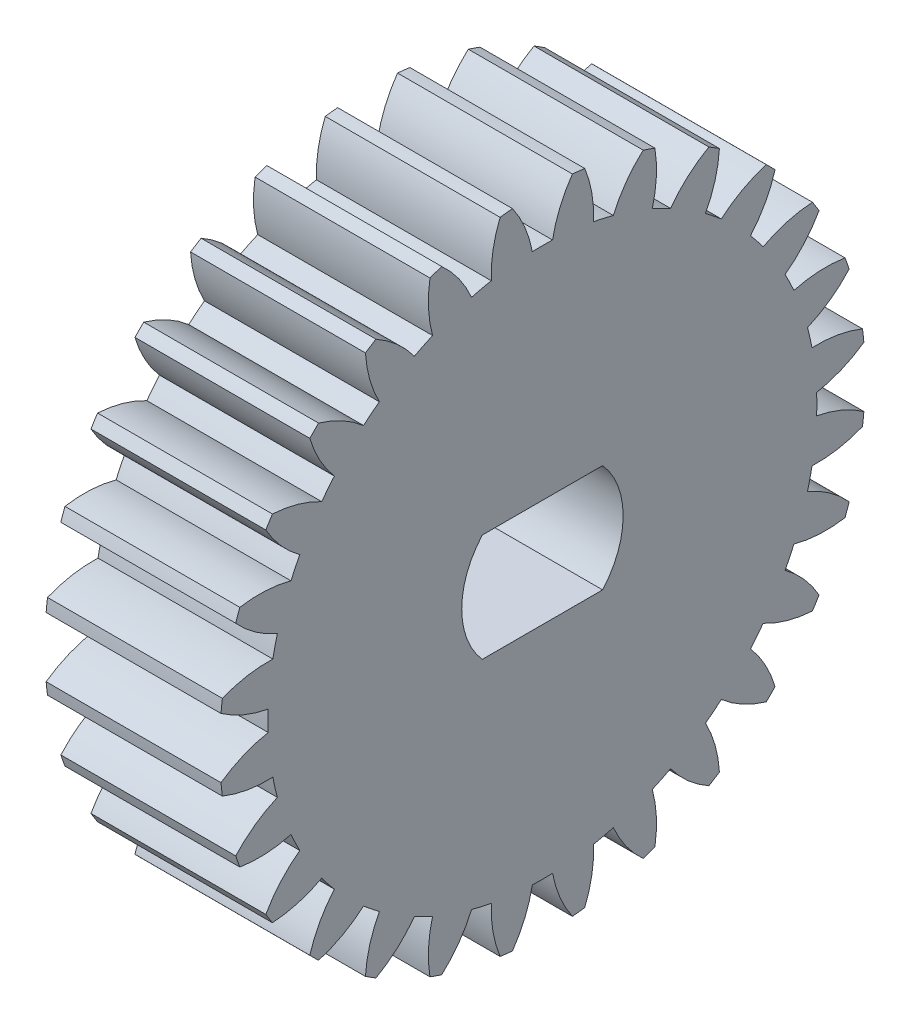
from build123d import *

# Parameters (mm, degrees)
BASPROSKE_W     = 6.5
BASPROSKE_H     = 12
TOOTHCUT_DEPTH  = 19.172781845
TEETHCUTS_COUNT = 28
BORE_DEPTH      = 50.0000508


with BuildPart() as part:
    # BasProSke → Base-Revolve (revolve)
    with BuildSketch(Plane(origin=(0, 0, 0), x_dir=(1, 0, 0), z_dir=(0, 1, 0)), mode=Mode.PRIVATE) as base_revolve_sk:
        with Locations((3.25, 6)):
            Rectangle(BASPROSKE_W, BASPROSKE_H)
    revolve(base_revolve_sk.sketch.rotate(Axis((-10, 0, 0), (1, 0, 0)), 180), axis=Axis((-10, 0, 0), (1, 0, 0)))

    # TooCutSke → ToothCut (cut, through all)
    with BuildSketch(Plane(origin=(0, 0, 0), x_dir=(0, 0, -1), z_dir=(1, 0, 0))):
        with BuildLine():
            ThreePointArc((0.376394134, 10.19205222), (0, 10.199), (-0.376394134, 10.19205222))
            ThreePointArc((-0.376394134, 10.19205222), (-0.656279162, 11.123259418), (-1.130491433, 11.972144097))
            ThreePointArc((-1.130491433, 11.972144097), (0, 12.0254), (1.130491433, 11.972144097))
            ThreePointArc((1.130491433, 11.972144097), (0.656279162, 11.123259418), (0.376394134, 10.19205222))
        make_face()
    toothcut = extrude(amount=TOOTHCUT_DEPTH, mode=Mode.SUBTRACT)

    # TeethCuts: ToothCut ×28 about axis
    teethcuts_axis = Axis((0, 0, 0), (1, 0, 0))
    for i in range(1, TEETHCUTS_COUNT):
        add(toothcut.rotate(teethcuts_axis, i * 360 / TEETHCUTS_COUNT), mode=Mode.SUBTRACT)

    # BorSke → Bore (cut, symmetric)
    with BuildSketch(Plane(origin=(0, 0, 0), x_dir=(0, 0, -1), z_dir=(1, 0, 0))):
        with BuildLine():
            Line((-2.236067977, 2), (2.236067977, 2))
            ThreePointArc((2.236067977, 2), (3, 0), (2.236067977, -2))
            Line((2.236067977, -2), (-2.236067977, -2))
            ThreePointArc((-2.236067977, -2), (-3, 0), (-2.236067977, 2))
        make_face()
    extrude(amount=BORE_DEPTH, both=True, mode=Mode.SUBTRACT)


solid = part.part
